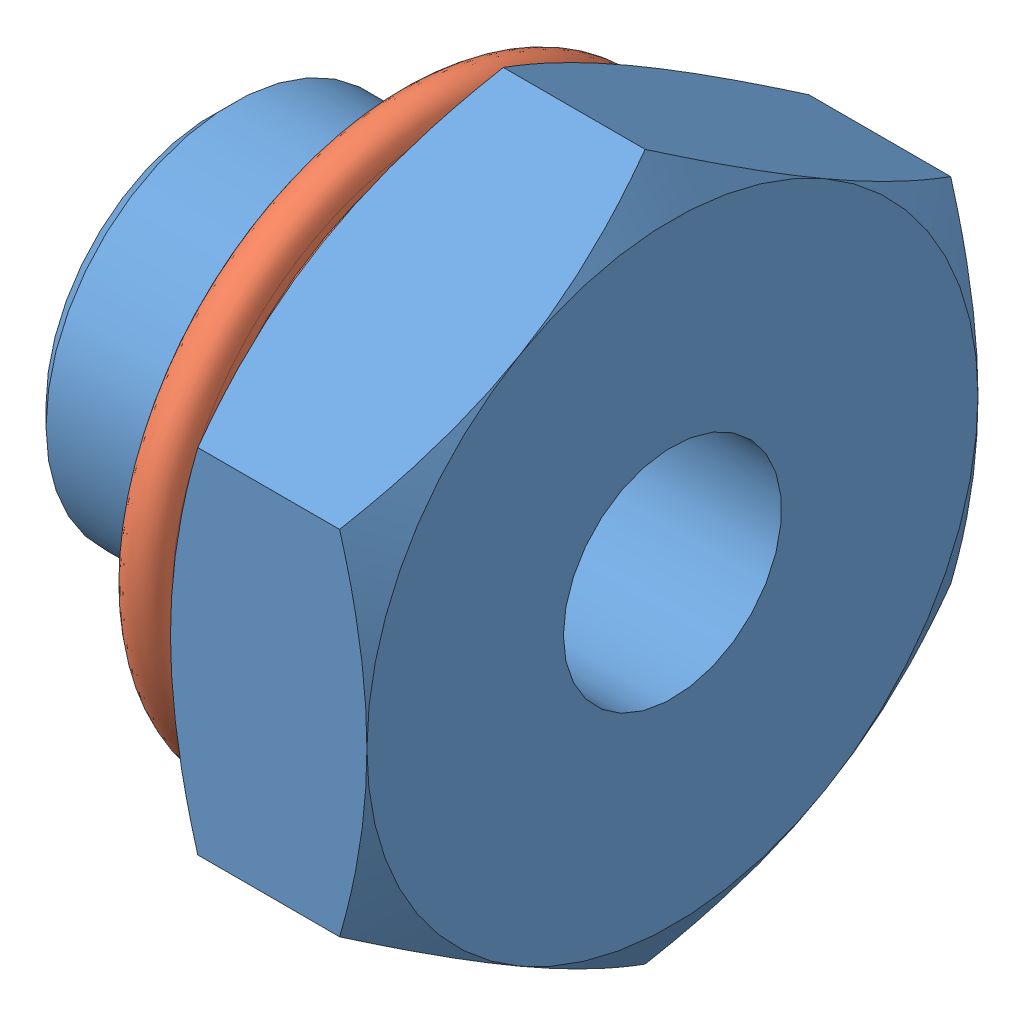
SolidWorks assembly Norgren-160231805.SLDASM, configuration Default (file format 8000). Lengths in mm.
Overall size (10.5 16.17 14).
3 component instances, 2 part files, 0 mates.
Components (placement in the parent):
- Norgren-160231805_16023(160231805)-1: Norgren-160231805_16023(160231805).sldasm [Default] at origin size (10.5 16.17 14)
  - Norgren-160231805_Reducer-Male BSPP x Female BSPP(160231805)-1: Norgren-160231805_Reducer-Male BSPP x Female BSPP(160231805).sldprt [Default] at (-0.0227 0.0112 0.0044) size (10.5 16.17 14)
  - Norgren-160231805_Copper Washer(48021301)-1: Norgren-160231805_Copper Washer(48021301).sldprt [Default] at (-1.8027 0.0112 0.0044) x (0 0 1) z (-1 0 0) size (13.4 13.4 1.78)
